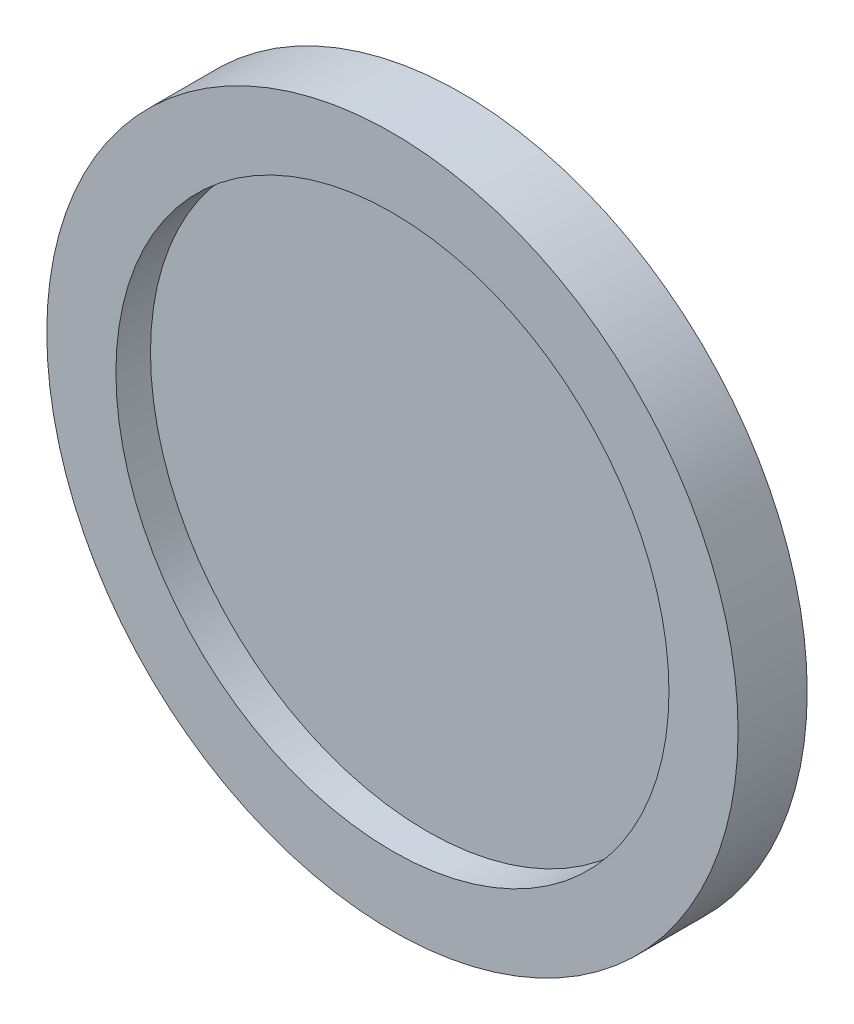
from build123d import *

# Parameters (mm, degrees)
SKETCH_2_R          = 5
EXTRUDE_2_DEPTH     = 1
SKETCH_3_R          = 4
CUT_EXTRUDE_1_DEPTH = 0.5


with BuildPart() as part:
    # Sketch 2 → Extrude 2 (new body)
    with BuildSketch(Plane.XY):
        Circle(SKETCH_2_R)
    extrude(amount=EXTRUDE_2_DEPTH)

    # Sketch 3 → Cut-Extrude 1 (cut)
    with BuildSketch(Plane.XY.offset(1)):
        Circle(SKETCH_3_R)
    extrude(amount=-CUT_EXTRUDE_1_DEPTH, mode=Mode.SUBTRACT)


solid = part.part
